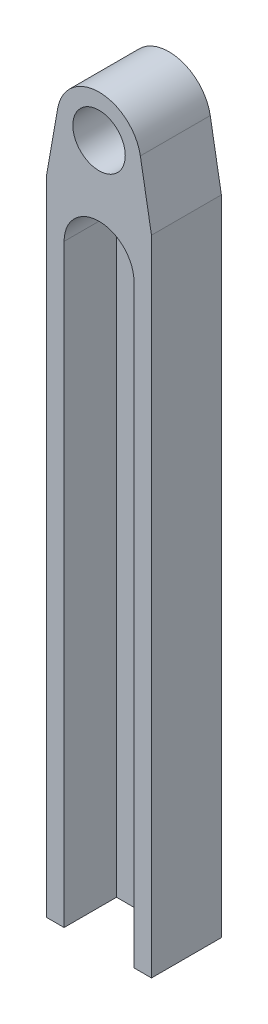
from build123d import *

# Parameters (mm, degrees)
SKETCH2_R           = 2.38125
BOSS_EXTRUDE1_DEPTH = 1.5875
BOSS_EXTRUDE2_START = 4.7625
SKETCH2_3_R         = 2.38125
BOSS_EXTRUDE2_DEPTH = 4.7625


with BuildPart() as part:
    # Sketch2 → Boss-Extrude1 (new body)
    with BuildSketch(Plane.XY):
        with BuildLine():
            Line((-4.7625, -5.068564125), (-4.7625, -63.5))
            Line((-4.7625, -63.5), (4.7625, -63.5))
            Line((4.7625, -63.5), (4.7625, -5.068564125))
            Line((4.7625, -5.068564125), (3.752117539, 0.661599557))
            ThreePointArc((3.752117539, 0.661599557), (0, 3.81), (-3.752117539, 0.661599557))
            Line((-3.752117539, 0.661599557), (-4.7625, -5.068564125))
        make_face()
        Circle(SKETCH2_R, mode=Mode.SUBTRACT)
    extrude(amount=-BOSS_EXTRUDE1_DEPTH)

    # Sketch2_3 → Boss-Extrude2 (add)
    with BuildSketch(Plane.XY.offset(BOSS_EXTRUDE2_START)):
        with BuildLine():
            Line((-3.752117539, 0.661599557), (-4.7625, -5.068564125))
            Line((-4.7625, -5.068564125), (-4.7625, -63.5))
            Line((-4.7625, -63.5), (-3.175, -63.5))
            Line((-3.175, -63.5), (-3.175, -9.525))
            ThreePointArc((-3.175, -9.525), (0, -6.35), (3.175, -9.525))
            Line((3.175, -9.525), (3.175, -63.5))
            Line((3.175, -63.5), (4.7625, -63.5))
            Line((4.7625, -63.5), (4.7625, -5.068564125))
            Line((4.7625, -5.068564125), (3.752117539, 0.661599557))
            ThreePointArc((3.752117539, 0.661599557), (0, 3.81), (-3.752117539, 0.661599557))
        make_face()
        Circle(SKETCH2_3_R, mode=Mode.SUBTRACT)
    extrude(amount=-BOSS_EXTRUDE2_DEPTH)


solid = part.part
